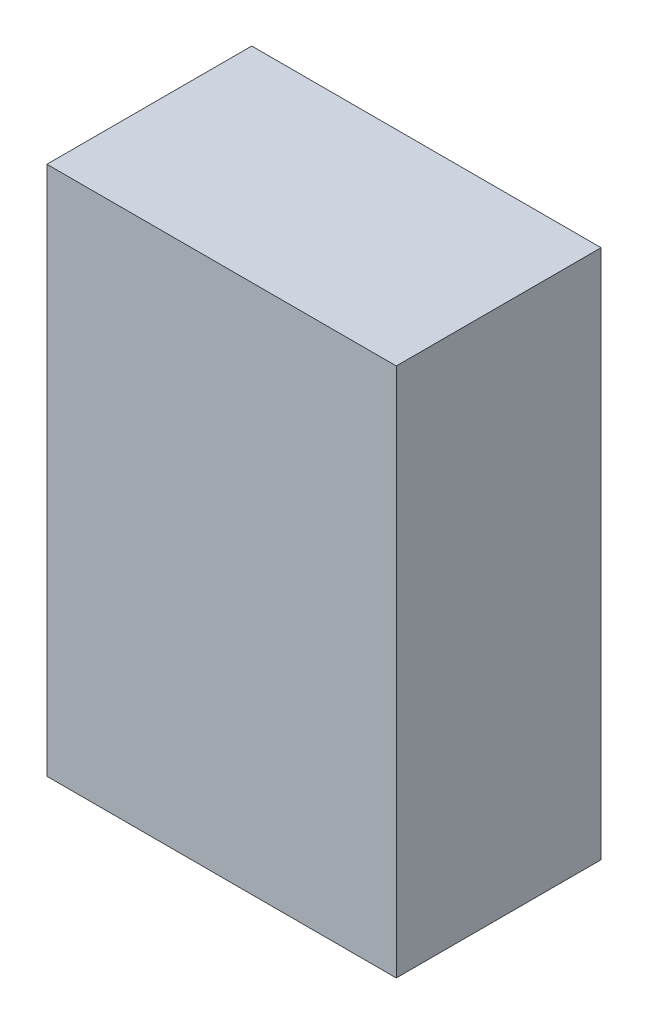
ISO-10303-21;
HEADER;
FILE_DESCRIPTION(('STEP AP214'),'2;1');
FILE_NAME('part.step','',(''),(''),'','','');
FILE_SCHEMA(('AUTOMOTIVE_DESIGN { 1 0 10303 214 1 1 1 1 }'));
ENDSEC;
DATA;
#1=APPLICATION_CONTEXT('core data for automotive mechanical design processes');
#2=APPLICATION_PROTOCOL_DEFINITION('international standard','automotive_design',2000,#1);
#3=PRODUCT_CONTEXT('',#1,'mechanical');
#4=PRODUCT('Part','Part','',(#3));
#5=PRODUCT_RELATED_PRODUCT_CATEGORY('part','',(#4));
#6=PRODUCT_DEFINITION_FORMATION('','',#4);
#7=PRODUCT_DEFINITION_CONTEXT('part definition',#1,'design');
#8=PRODUCT_DEFINITION('design','',#6,#7);
#9=PRODUCT_DEFINITION_SHAPE('','',#8);
#10=(LENGTH_UNIT() NAMED_UNIT(*) SI_UNIT(.MILLI.,.METRE.));
#11=(NAMED_UNIT(*) PLANE_ANGLE_UNIT() SI_UNIT($,.RADIAN.));
#12=(NAMED_UNIT(*) SI_UNIT($,.STERADIAN.) SOLID_ANGLE_UNIT());
#13=UNCERTAINTY_MEASURE_WITH_UNIT(LENGTH_MEASURE(1.E-05),#10,'distance_accuracy_value','');
#14=(GEOMETRIC_REPRESENTATION_CONTEXT(3) GLOBAL_UNCERTAINTY_ASSIGNED_CONTEXT((#13)) GLOBAL_UNIT_ASSIGNED_CONTEXT((#10,
#11,#12)) REPRESENTATION_CONTEXT('',''));
#15=CARTESIAN_POINT('',(0.,0.,0.));
#16=DIRECTION('',(0.,0.,1.));
#17=DIRECTION('',(1.,0.,0.));
#18=AXIS2_PLACEMENT_3D('',#15,#16,#17);
#19=CARTESIAN_POINT('',(0.,0.,34.));
#20=DIRECTION('',(1.,0.,0.));
#21=DIRECTION('',(0.,0.,-1.));
#22=AXIS2_PLACEMENT_3D('',#19,#20,#21);
#23=PLANE('',#22);
#24=DIRECTION('',(0.,-1.,0.));
#25=VECTOR('',#24,1.);
#26=CARTESIAN_POINT('',(0.,0.,0.));
#27=LINE('',#26,#25);
#28=CARTESIAN_POINT('',(0.,88.,0.));
#29=VERTEX_POINT('',#28);
#30=CARTESIAN_POINT('',(0.,0.,0.));
#31=VERTEX_POINT('',#30);
#32=EDGE_CURVE('E96',#29,#31,#27,.T.);
#33=ORIENTED_EDGE('',*,*,#32,.T.);
#34=DIRECTION('',(0.,0.,-1.));
#35=VECTOR('',#34,1.);
#36=CARTESIAN_POINT('',(0.,0.,34.));
#37=LINE('',#36,#35);
#38=CARTESIAN_POINT('',(0.,0.,34.));
#39=VERTEX_POINT('',#38);
#40=EDGE_CURVE('E11',#39,#31,#37,.T.);
#41=ORIENTED_EDGE('',*,*,#40,.F.);
#42=DIRECTION('',(0.,-1.,0.));
#43=VECTOR('',#42,1.);
#44=CARTESIAN_POINT('',(0.,0.,34.));
#45=LINE('',#44,#43);
#46=CARTESIAN_POINT('',(0.,88.,34.));
#47=VERTEX_POINT('',#46);
#48=EDGE_CURVE('E84',#47,#39,#45,.T.);
#49=ORIENTED_EDGE('',*,*,#48,.F.);
#50=DIRECTION('',(0.,0.,-1.));
#51=VECTOR('',#50,1.);
#52=CARTESIAN_POINT('',(0.,88.,34.));
#53=LINE('',#52,#51);
#54=EDGE_CURVE('E92',#47,#29,#53,.T.);
#55=ORIENTED_EDGE('',*,*,#54,.T.);
#56=EDGE_LOOP('',(#33,#41,#49,#55));
#57=FACE_BOUND('',#56,.T.);
#58=ADVANCED_FACE('F33',(#57),#23,.F.);
#59=CARTESIAN_POINT('',(0.,0.,34.));
#60=DIRECTION('',(0.,1.,0.));
#61=DIRECTION('',(0.,0.,1.));
#62=AXIS2_PLACEMENT_3D('',#59,#60,#61);
#63=PLANE('',#62);
#64=DIRECTION('',(1.,0.,0.));
#65=VECTOR('',#64,1.);
#66=CARTESIAN_POINT('',(0.,0.,0.));
#67=LINE('',#66,#65);
#68=CARTESIAN_POINT('',(58.,0.,0.));
#69=VERTEX_POINT('',#68);
#70=EDGE_CURVE('E88',#31,#69,#67,.T.);
#71=ORIENTED_EDGE('',*,*,#70,.T.);
#72=DIRECTION('',(0.,0.,-1.));
#73=VECTOR('',#72,1.);
#74=CARTESIAN_POINT('',(58.,0.,34.));
#75=LINE('',#74,#73);
#76=CARTESIAN_POINT('',(58.,0.,34.));
#77=VERTEX_POINT('',#76);
#78=EDGE_CURVE('E41',#77,#69,#75,.T.);
#79=ORIENTED_EDGE('',*,*,#78,.F.);
#80=DIRECTION('',(1.,0.,0.));
#81=VECTOR('',#80,1.);
#82=CARTESIAN_POINT('',(0.,0.,34.));
#83=LINE('',#82,#81);
#84=EDGE_CURVE('E79',#39,#77,#83,.T.);
#85=ORIENTED_EDGE('',*,*,#84,.F.);
#86=ORIENTED_EDGE('',*,*,#40,.T.);
#87=EDGE_LOOP('',(#71,#79,#85,#86));
#88=FACE_BOUND('',#87,.T.);
#89=ADVANCED_FACE('F87',(#88),#63,.F.);
#90=CARTESIAN_POINT('',(58.,0.,34.));
#91=DIRECTION('',(-1.,0.,0.));
#92=DIRECTION('',(0.,0.,1.));
#93=AXIS2_PLACEMENT_3D('',#90,#91,#92);
#94=PLANE('',#93);
#95=DIRECTION('',(0.,1.,0.));
#96=VECTOR('',#95,1.);
#97=CARTESIAN_POINT('',(58.,0.,0.));
#98=LINE('',#97,#96);
#99=CARTESIAN_POINT('',(58.,88.,0.));
#100=VERTEX_POINT('',#99);
#101=EDGE_CURVE('E66',#69,#100,#98,.T.);
#102=ORIENTED_EDGE('',*,*,#101,.T.);
#103=DIRECTION('',(0.,0.,-1.));
#104=VECTOR('',#103,1.);
#105=CARTESIAN_POINT('',(58.,88.,34.));
#106=LINE('',#105,#104);
#107=CARTESIAN_POINT('',(58.,88.,34.));
#108=VERTEX_POINT('',#107);
#109=EDGE_CURVE('E89',#108,#100,#106,.T.);
#110=ORIENTED_EDGE('',*,*,#109,.F.);
#111=DIRECTION('',(0.,1.,0.));
#112=VECTOR('',#111,1.);
#113=CARTESIAN_POINT('',(58.,0.,34.));
#114=LINE('',#113,#112);
#115=EDGE_CURVE('E82',#77,#108,#114,.T.);
#116=ORIENTED_EDGE('',*,*,#115,.F.);
#117=ORIENTED_EDGE('',*,*,#78,.T.);
#118=EDGE_LOOP('',(#102,#110,#116,#117));
#119=FACE_BOUND('',#118,.T.);
#120=ADVANCED_FACE('F90',(#119),#94,.F.);
#121=CARTESIAN_POINT('',(0.,88.,34.));
#122=DIRECTION('',(0.,-1.,0.));
#123=DIRECTION('',(0.,0.,-1.));
#124=AXIS2_PLACEMENT_3D('',#121,#122,#123);
#125=PLANE('',#124);
#126=DIRECTION('',(-1.,0.,0.));
#127=VECTOR('',#126,1.);
#128=CARTESIAN_POINT('',(0.,88.,0.));
#129=LINE('',#128,#127);
#130=EDGE_CURVE('E72',#100,#29,#129,.T.);
#131=ORIENTED_EDGE('',*,*,#130,.T.);
#132=ORIENTED_EDGE('',*,*,#54,.F.);
#133=DIRECTION('',(-1.,0.,0.));
#134=VECTOR('',#133,1.);
#135=CARTESIAN_POINT('',(0.,88.,34.));
#136=LINE('',#135,#134);
#137=EDGE_CURVE('E49',#108,#47,#136,.T.);
#138=ORIENTED_EDGE('',*,*,#137,.F.);
#139=ORIENTED_EDGE('',*,*,#109,.T.);
#140=EDGE_LOOP('',(#131,#132,#138,#139));
#141=FACE_BOUND('',#140,.T.);
#142=ADVANCED_FACE('F103',(#141),#125,.F.);
#143=CARTESIAN_POINT('',(0.,0.,34.));
#144=DIRECTION('',(0.,0.,-1.));
#145=DIRECTION('',(-1.,0.,0.));
#146=AXIS2_PLACEMENT_3D('',#143,#144,#145);
#147=PLANE('',#146);
#148=ORIENTED_EDGE('',*,*,#48,.T.);
#149=ORIENTED_EDGE('',*,*,#84,.T.);
#150=ORIENTED_EDGE('',*,*,#115,.T.);
#151=ORIENTED_EDGE('',*,*,#137,.T.);
#152=EDGE_LOOP('',(#148,#149,#150,#151));
#153=FACE_BOUND('',#152,.T.);
#154=ADVANCED_FACE('F80',(#153),#147,.F.);
#155=CARTESIAN_POINT('',(0.,0.,0.));
#156=DIRECTION('',(0.,0.,-1.));
#157=DIRECTION('',(-1.,0.,0.));
#158=AXIS2_PLACEMENT_3D('',#155,#156,#157);
#159=PLANE('',#158);
#160=ORIENTED_EDGE('',*,*,#32,.F.);
#161=ORIENTED_EDGE('',*,*,#130,.F.);
#162=ORIENTED_EDGE('',*,*,#101,.F.);
#163=ORIENTED_EDGE('',*,*,#70,.F.);
#164=EDGE_LOOP('',(#160,#161,#162,#163));
#165=FACE_BOUND('',#164,.T.);
#166=ADVANCED_FACE('F106',(#165),#159,.T.);
#167=CLOSED_SHELL('',(#58,#89,#120,#142,#154,#166));
#168=MANIFOLD_SOLID_BREP('B2',#167);
#169=ADVANCED_BREP_SHAPE_REPRESENTATION('',(#18,#168),#14);
#170=SHAPE_DEFINITION_REPRESENTATION(#9,#169);
ENDSEC;
END-ISO-10303-21;
